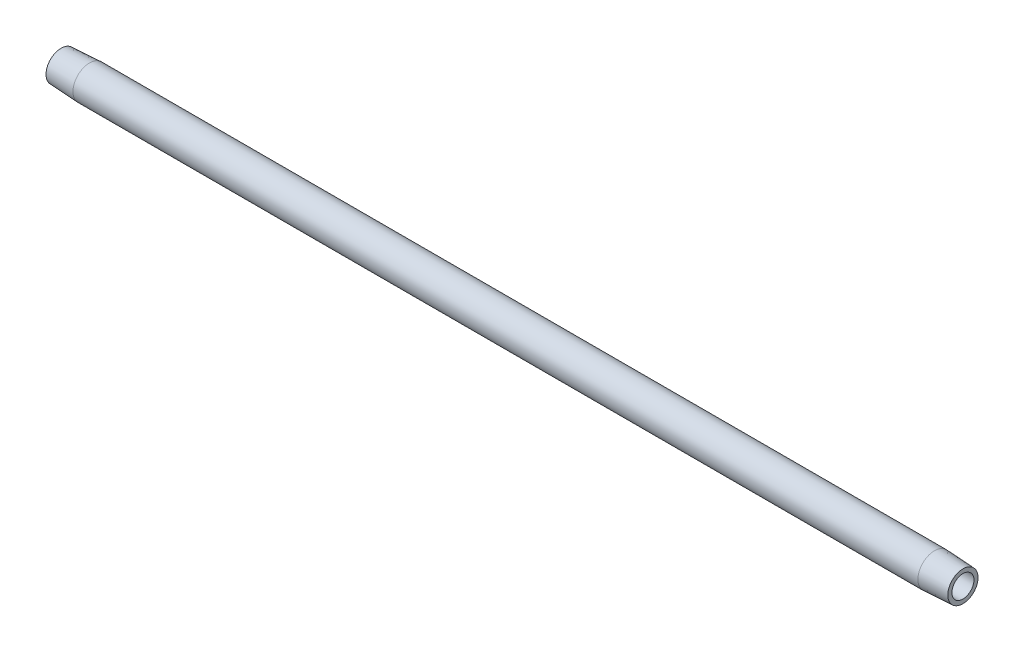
from build123d import *


with BuildPart() as part:
    # Sketch2 → Revolve1 (revolve)
    with BuildSketch(Plane.XY, mode=Mode.PRIVATE) as revolve1_sk:
        Polygon((8.810039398, 5.1435), (0, 4.6817854), (0, 3.4163), (279.4, 3.4163), (279.4, 4.6817854), (270.589960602, 5.1435), align=None)
    revolve(revolve1_sk.sketch.rotate(Axis((0.476141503, 0, 0), (1, 0, 0)), 90), axis=Axis((0.476141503, 0, 0), (1, 0, 0)))


solid = part.part
